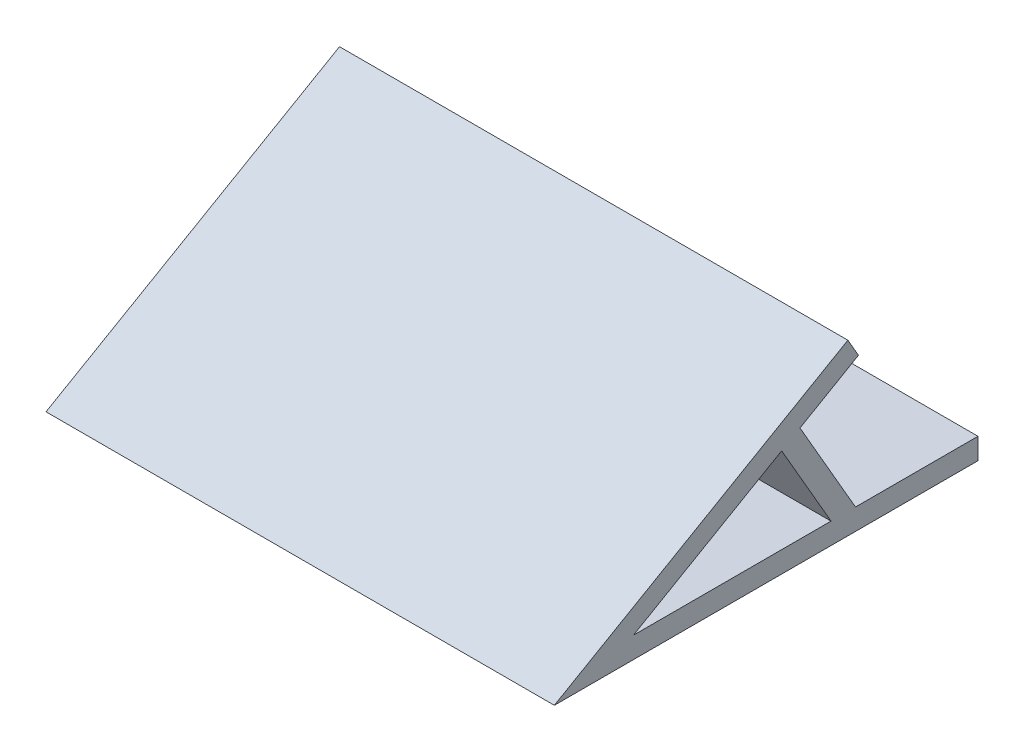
from build123d import *

# Parameters (mm, degrees)
BOSS_EXTRUDE1_DEPTH = 60


with BuildPart() as part:
    # Sketch1 → Boss-Extrude1 (new body)
    with BuildSketch(Plane(origin=(0, 0, 0), x_dir=(0, 0, -1), z_dir=(1, 0, 0))):
        Polygon((-5.557481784, 2.5), (8.900612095, 2.5), (8.900612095, 0), (0, 0), (-41.099387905, 0), (-6.458371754, 20), (-5.208371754, 17.834936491), (-12.11042656, 13.850033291), align=None)
        Polygon((-14.275490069, 12.600033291), (-31.769260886, 2.5), (-8.44423313, 2.5), align=None, mode=Mode.SUBTRACT)
    extrude(amount=BOSS_EXTRUDE1_DEPTH)


solid = part.part
